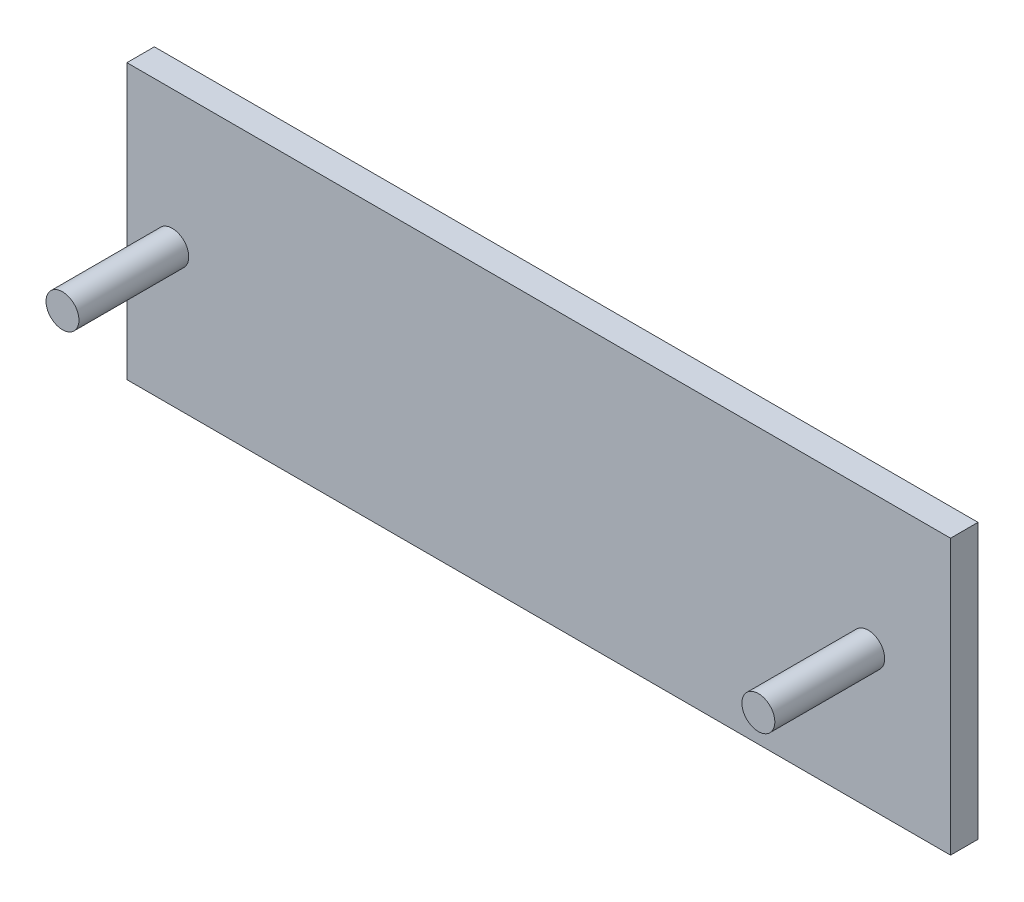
from build123d import *

# Parameters (mm, degrees)
SKIZZE1_W               = 300
SKIZZE1_H               = 100
LINEAR_AUSTRAGEN1_DEPTH = 10
SKIZZE2_R               = 6
LINEAR_AUSTRAGEN2_DEPTH = 40
SKIZZE3_R               = 6
LINEAR_AUSTRAGEN3_DEPTH = 40


with BuildPart() as part:
    # Skizze1 → Linear austragen1 (new body)
    with BuildSketch(Plane.XY):
        with Locations((150, 50)):
            Rectangle(SKIZZE1_W, SKIZZE1_H)
    extrude(amount=LINEAR_AUSTRAGEN1_DEPTH)

    # Skizze2 → Linear austragen2 (add)
    with BuildSketch(Plane.XY.offset(10)):
        with Locations(Location((16.53, 50, 0), (0, 0, 180))):
            Circle(SKIZZE2_R)
    extrude(amount=LINEAR_AUSTRAGEN2_DEPTH)

    # Skizze3 → Linear austragen3 (add)
    with BuildSketch(Plane.XY.offset(10)):
        with Locations(Location((270, 50, 0), (0, 0, 180))):
            Circle(SKIZZE3_R)
    extrude(amount=LINEAR_AUSTRAGEN3_DEPTH)


solid = part.part
